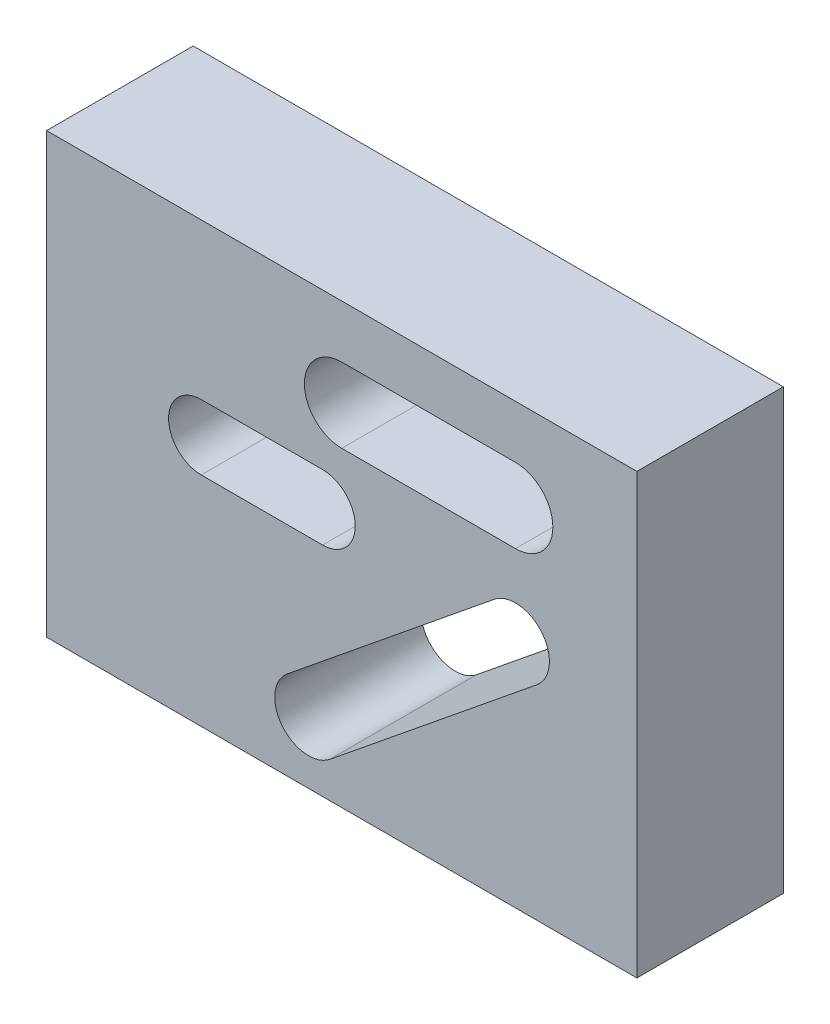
ISO-10303-21;
HEADER;
FILE_DESCRIPTION(('STEP AP214'),'2;1');
FILE_NAME('part.step','',(''),(''),'','','');
FILE_SCHEMA(('AUTOMOTIVE_DESIGN { 1 0 10303 214 1 1 1 1 }'));
ENDSEC;
DATA;
#1=APPLICATION_CONTEXT('core data for automotive mechanical design processes');
#2=APPLICATION_PROTOCOL_DEFINITION('international standard','automotive_design',2000,#1);
#3=PRODUCT_CONTEXT('',#1,'mechanical');
#4=PRODUCT('Part','Part','',(#3));
#5=PRODUCT_RELATED_PRODUCT_CATEGORY('part','',(#4));
#6=PRODUCT_DEFINITION_FORMATION('','',#4);
#7=PRODUCT_DEFINITION_CONTEXT('part definition',#1,'design');
#8=PRODUCT_DEFINITION('design','',#6,#7);
#9=PRODUCT_DEFINITION_SHAPE('','',#8);
#10=(LENGTH_UNIT() NAMED_UNIT(*) SI_UNIT(.MILLI.,.METRE.));
#11=(NAMED_UNIT(*) PLANE_ANGLE_UNIT() SI_UNIT($,.RADIAN.));
#12=(NAMED_UNIT(*) SI_UNIT($,.STERADIAN.) SOLID_ANGLE_UNIT());
#13=UNCERTAINTY_MEASURE_WITH_UNIT(LENGTH_MEASURE(1.E-05),#10,'distance_accuracy_value','');
#14=(GEOMETRIC_REPRESENTATION_CONTEXT(3) GLOBAL_UNCERTAINTY_ASSIGNED_CONTEXT((#13)) GLOBAL_UNIT_ASSIGNED_CONTEXT((#10,
#11,#12)) REPRESENTATION_CONTEXT('',''));
#15=CARTESIAN_POINT('',(0.,0.,0.));
#16=DIRECTION('',(0.,0.,1.));
#17=DIRECTION('',(1.,0.,0.));
#18=AXIS2_PLACEMENT_3D('',#15,#16,#17);
#19=CARTESIAN_POINT('',(0.,0.,26.));
#20=DIRECTION('',(0.,0.,-1.));
#21=DIRECTION('',(-1.,0.,0.));
#22=AXIS2_PLACEMENT_3D('',#19,#20,#21);
#23=PLANE('',#22);
#24=CARTESIAN_POINT('',(27.4409169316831,44.4523985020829,26.));
#25=DIRECTION('',(0.,0.,1.));
#26=DIRECTION('',(1.,0.,0.));
#27=AXIS2_PLACEMENT_3D('',#24,#25,#26);
#28=CIRCLE('',#27,5.79813893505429);
#29=CARTESIAN_POINT('',(27.4409169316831,50.2505374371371,26.));
#30=VERTEX_POINT('',#29);
#31=CARTESIAN_POINT('',(27.4409169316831,38.6542595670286,26.));
#32=VERTEX_POINT('',#31);
#33=EDGE_CURVE('E182',#30,#32,#28,.T.);
#34=ORIENTED_EDGE('',*,*,#33,.F.);
#35=DIRECTION('',(-1.,0.,0.));
#36=VECTOR('',#35,1.);
#37=CARTESIAN_POINT('',(27.4409169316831,50.2505374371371,26.));
#38=LINE('',#37,#36);
#39=CARTESIAN_POINT('',(48.976861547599,50.2505374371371,26.));
#40=VERTEX_POINT('',#39);
#41=EDGE_CURVE('E190',#40,#30,#38,.T.);
#42=ORIENTED_EDGE('',*,*,#41,.F.);
#43=CARTESIAN_POINT('',(48.976861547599,44.4523985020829,26.));
#44=DIRECTION('',(0.,0.,1.));
#45=DIRECTION('',(1.,0.,0.));
#46=AXIS2_PLACEMENT_3D('',#43,#44,#45);
#47=CIRCLE('',#46,5.79813893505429);
#48=CARTESIAN_POINT('',(48.976861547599,38.6542595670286,26.));
#49=VERTEX_POINT('',#48);
#50=EDGE_CURVE('E187',#49,#40,#47,.T.);
#51=ORIENTED_EDGE('',*,*,#50,.F.);
#52=DIRECTION('',(1.,0.,0.));
#53=VECTOR('',#52,1.);
#54=CARTESIAN_POINT('',(27.4409169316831,38.6542595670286,26.));
#55=LINE('',#54,#53);
#56=EDGE_CURVE('E184',#32,#49,#55,.T.);
#57=ORIENTED_EDGE('',*,*,#56,.F.);
#58=EDGE_LOOP('',(#34,#42,#51,#57));
#59=FACE_BOUND('',#58,.T.);
#60=DIRECTION('',(0.,-1.,0.));
#61=VECTOR('',#60,1.);
#62=CARTESIAN_POINT('',(0.,0.,26.));
#63=LINE('',#62,#61);
#64=CARTESIAN_POINT('',(0.,77.8607228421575,26.));
#65=VERTEX_POINT('',#64);
#66=CARTESIAN_POINT('',(0.,0.,26.));
#67=VERTEX_POINT('',#66);
#68=EDGE_CURVE('E244',#65,#67,#63,.T.);
#69=ORIENTED_EDGE('',*,*,#68,.T.);
#70=DIRECTION('',(1.,0.,0.));
#71=VECTOR('',#70,1.);
#72=CARTESIAN_POINT('',(0.,0.,26.));
#73=LINE('',#72,#71);
#74=CARTESIAN_POINT('',(104.74943606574,0.,26.));
#75=VERTEX_POINT('',#74);
#76=EDGE_CURVE('E247',#67,#75,#73,.T.);
#77=ORIENTED_EDGE('',*,*,#76,.T.);
#78=DIRECTION('',(0.,1.,0.));
#79=VECTOR('',#78,1.);
#80=CARTESIAN_POINT('',(104.74943606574,0.,26.));
#81=LINE('',#80,#79);
#82=CARTESIAN_POINT('',(104.74943606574,77.8607228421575,26.));
#83=VERTEX_POINT('',#82);
#84=EDGE_CURVE('E250',#75,#83,#81,.T.);
#85=ORIENTED_EDGE('',*,*,#84,.T.);
#86=DIRECTION('',(-1.,0.,0.));
#87=VECTOR('',#86,1.);
#88=CARTESIAN_POINT('',(0.,77.8607228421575,26.));
#89=LINE('',#88,#87);
#90=EDGE_CURVE('E252',#83,#65,#89,.T.);
#91=ORIENTED_EDGE('',*,*,#90,.T.);
#92=EDGE_LOOP('',(#69,#77,#85,#91));
#93=FACE_BOUND('',#92,.T.);
#94=CARTESIAN_POINT('',(52.3747180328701,61.8468153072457,26.));
#95=DIRECTION('',(0.,0.,1.));
#96=DIRECTION('',(1.,0.,0.));
#97=AXIS2_PLACEMENT_3D('',#94,#95,#96);
#98=CIRCLE('',#97,6.6264444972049);
#99=CARTESIAN_POINT('',(52.3747180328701,68.4732598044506,26.));
#100=VERTEX_POINT('',#99);
#101=CARTESIAN_POINT('',(52.3747180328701,55.2203708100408,26.));
#102=VERTEX_POINT('',#101);
#103=EDGE_CURVE('E213',#100,#102,#98,.T.);
#104=ORIENTED_EDGE('',*,*,#103,.F.);
#105=DIRECTION('',(-1.,0.,0.));
#106=VECTOR('',#105,1.);
#107=CARTESIAN_POINT('',(52.3747180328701,68.4732598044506,26.));
#108=LINE('',#107,#106);
#109=CARTESIAN_POINT('',(83.2134914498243,68.4732598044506,26.));
#110=VERTEX_POINT('',#109);
#111=EDGE_CURVE('E221',#110,#100,#108,.T.);
#112=ORIENTED_EDGE('',*,*,#111,.F.);
#113=CARTESIAN_POINT('',(83.2134914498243,61.8468153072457,26.));
#114=DIRECTION('',(0.,0.,1.));
#115=DIRECTION('',(1.,0.,0.));
#116=AXIS2_PLACEMENT_3D('',#113,#114,#115);
#117=CIRCLE('',#116,6.6264444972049);
#118=CARTESIAN_POINT('',(83.2134914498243,55.2203708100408,26.));
#119=VERTEX_POINT('',#118);
#120=EDGE_CURVE('E218',#119,#110,#117,.T.);
#121=ORIENTED_EDGE('',*,*,#120,.F.);
#122=DIRECTION('',(1.,0.,0.));
#123=VECTOR('',#122,1.);
#124=CARTESIAN_POINT('',(52.3747180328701,55.2203708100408,26.));
#125=LINE('',#124,#123);
#126=EDGE_CURVE('E215',#102,#119,#125,.T.);
#127=ORIENTED_EDGE('',*,*,#126,.F.);
#128=EDGE_LOOP('',(#104,#112,#121,#127));
#129=FACE_BOUND('',#128,.T.);
#130=CARTESIAN_POINT('',(83.2134914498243,40.8630743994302,26.));
#131=DIRECTION('',(0.,0.,1.));
#132=DIRECTION('',(1.,0.,0.));
#133=AXIS2_PLACEMENT_3D('',#130,#131,#132);
#134=CIRCLE('',#133,6.01268323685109);
#135=CARTESIAN_POINT('',(87.0037237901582,36.1954734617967,26.));
#136=VERTEX_POINT('',#135);
#137=CARTESIAN_POINT('',(79.4232591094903,45.5306753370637,26.));
#138=VERTEX_POINT('',#137);
#139=EDGE_CURVE('E146',#136,#138,#134,.T.);
#140=ORIENTED_EDGE('',*,*,#139,.F.);
#141=DIRECTION('',(0.77629250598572,0.630372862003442,0.));
#142=VECTOR('',#141,1.);
#143=CARTESIAN_POINT('',(87.0037237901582,36.1954734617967,26.));
#144=LINE('',#143,#142);
#145=CARTESIAN_POINT('',(50.2821772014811,6.3764732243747,26.));
#146=VERTEX_POINT('',#145);
#147=EDGE_CURVE('E168',#146,#136,#144,.T.);
#148=ORIENTED_EDGE('',*,*,#147,.F.);
#149=CARTESIAN_POINT('',(46.4919448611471,11.0440741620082,26.));
#150=DIRECTION('',(0.,0.,1.));
#151=DIRECTION('',(1.,0.,0.));
#152=AXIS2_PLACEMENT_3D('',#149,#150,#151);
#153=CIRCLE('',#152,6.01268323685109);
#154=CARTESIAN_POINT('',(42.7017125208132,15.7116750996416,26.));
#155=VERTEX_POINT('',#154);
#156=EDGE_CURVE('E166',#155,#146,#153,.T.);
#157=ORIENTED_EDGE('',*,*,#156,.F.);
#158=DIRECTION('',(-0.776292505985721,-0.630372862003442,0.));
#159=VECTOR('',#158,1.);
#160=CARTESIAN_POINT('',(79.4232591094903,45.5306753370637,26.));
#161=LINE('',#160,#159);
#162=EDGE_CURVE('E154',#138,#155,#161,.T.);
#163=ORIENTED_EDGE('',*,*,#162,.F.);
#164=EDGE_LOOP('',(#140,#148,#157,#163));
#165=FACE_BOUND('',#164,.T.);
#166=ADVANCED_FACE('F33',(#59,#93,#129,#165),#23,.F.);
#167=CARTESIAN_POINT('',(0.,0.,0.));
#168=DIRECTION('',(0.,0.,-1.));
#169=DIRECTION('',(-1.,0.,0.));
#170=AXIS2_PLACEMENT_3D('',#167,#168,#169);
#171=PLANE('',#170);
#172=DIRECTION('',(-1.,0.,0.));
#173=VECTOR('',#172,1.);
#174=CARTESIAN_POINT('',(27.4409169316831,50.2505374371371,0.));
#175=LINE('',#174,#173);
#176=CARTESIAN_POINT('',(48.976861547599,50.2505374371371,0.));
#177=VERTEX_POINT('',#176);
#178=CARTESIAN_POINT('',(27.4409169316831,50.2505374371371,0.));
#179=VERTEX_POINT('',#178);
#180=EDGE_CURVE('E185',#177,#179,#175,.T.);
#181=ORIENTED_EDGE('',*,*,#180,.T.);
#182=CARTESIAN_POINT('',(27.4409169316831,44.4523985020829,0.));
#183=DIRECTION('',(0.,0.,1.));
#184=DIRECTION('',(1.,0.,0.));
#185=AXIS2_PLACEMENT_3D('',#182,#183,#184);
#186=CIRCLE('',#185,5.79813893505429);
#187=CARTESIAN_POINT('',(27.4409169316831,38.6542595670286,0.));
#188=VERTEX_POINT('',#187);
#189=EDGE_CURVE('E162',#179,#188,#186,.T.);
#190=ORIENTED_EDGE('',*,*,#189,.T.);
#191=DIRECTION('',(1.,0.,0.));
#192=VECTOR('',#191,1.);
#193=CARTESIAN_POINT('',(27.4409169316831,38.6542595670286,0.));
#194=LINE('',#193,#192);
#195=CARTESIAN_POINT('',(48.976861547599,38.6542595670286,0.));
#196=VERTEX_POINT('',#195);
#197=EDGE_CURVE('E195',#188,#196,#194,.T.);
#198=ORIENTED_EDGE('',*,*,#197,.T.);
#199=CARTESIAN_POINT('',(48.976861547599,44.4523985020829,0.));
#200=DIRECTION('',(0.,0.,1.));
#201=DIRECTION('',(1.,0.,0.));
#202=AXIS2_PLACEMENT_3D('',#199,#200,#201);
#203=CIRCLE('',#202,5.79813893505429);
#204=EDGE_CURVE('E198',#196,#177,#203,.T.);
#205=ORIENTED_EDGE('',*,*,#204,.T.);
#206=EDGE_LOOP('',(#181,#190,#198,#205));
#207=FACE_BOUND('',#206,.T.);
#208=DIRECTION('',(0.,-1.,0.));
#209=VECTOR('',#208,1.);
#210=CARTESIAN_POINT('',(0.,0.,0.));
#211=LINE('',#210,#209);
#212=CARTESIAN_POINT('',(0.,77.8607228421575,0.));
#213=VERTEX_POINT('',#212);
#214=CARTESIAN_POINT('',(0.,0.,0.));
#215=VERTEX_POINT('',#214);
#216=EDGE_CURVE('E243',#213,#215,#211,.T.);
#217=ORIENTED_EDGE('',*,*,#216,.F.);
#218=DIRECTION('',(-1.,0.,0.));
#219=VECTOR('',#218,1.);
#220=CARTESIAN_POINT('',(0.,77.8607228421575,0.));
#221=LINE('',#220,#219);
#222=CARTESIAN_POINT('',(104.74943606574,77.8607228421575,0.));
#223=VERTEX_POINT('',#222);
#224=EDGE_CURVE('E248',#223,#213,#221,.T.);
#225=ORIENTED_EDGE('',*,*,#224,.F.);
#226=DIRECTION('',(0.,1.,0.));
#227=VECTOR('',#226,1.);
#228=CARTESIAN_POINT('',(104.74943606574,0.,0.));
#229=LINE('',#228,#227);
#230=CARTESIAN_POINT('',(104.74943606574,0.,0.));
#231=VERTEX_POINT('',#230);
#232=EDGE_CURVE('E259',#231,#223,#229,.T.);
#233=ORIENTED_EDGE('',*,*,#232,.F.);
#234=DIRECTION('',(1.,0.,0.));
#235=VECTOR('',#234,1.);
#236=CARTESIAN_POINT('',(0.,0.,0.));
#237=LINE('',#236,#235);
#238=EDGE_CURVE('E257',#215,#231,#237,.T.);
#239=ORIENTED_EDGE('',*,*,#238,.F.);
#240=EDGE_LOOP('',(#217,#225,#233,#239));
#241=FACE_BOUND('',#240,.T.);
#242=DIRECTION('',(-1.,0.,0.));
#243=VECTOR('',#242,1.);
#244=CARTESIAN_POINT('',(52.3747180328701,68.4732598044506,0.));
#245=LINE('',#244,#243);
#246=CARTESIAN_POINT('',(83.2134914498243,68.4732598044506,0.));
#247=VERTEX_POINT('',#246);
#248=CARTESIAN_POINT('',(52.3747180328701,68.4732598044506,0.));
#249=VERTEX_POINT('',#248);
#250=EDGE_CURVE('E216',#247,#249,#245,.T.);
#251=ORIENTED_EDGE('',*,*,#250,.T.);
#252=CARTESIAN_POINT('',(52.3747180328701,61.8468153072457,0.));
#253=DIRECTION('',(0.,0.,1.));
#254=DIRECTION('',(1.,0.,0.));
#255=AXIS2_PLACEMENT_3D('',#252,#253,#254);
#256=CIRCLE('',#255,6.6264444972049);
#257=CARTESIAN_POINT('',(52.3747180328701,55.2203708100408,0.));
#258=VERTEX_POINT('',#257);
#259=EDGE_CURVE('E212',#249,#258,#256,.T.);
#260=ORIENTED_EDGE('',*,*,#259,.T.);
#261=DIRECTION('',(1.,0.,0.));
#262=VECTOR('',#261,1.);
#263=CARTESIAN_POINT('',(52.3747180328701,55.2203708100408,0.));
#264=LINE('',#263,#262);
#265=CARTESIAN_POINT('',(83.2134914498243,55.2203708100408,0.));
#266=VERTEX_POINT('',#265);
#267=EDGE_CURVE('E226',#258,#266,#264,.T.);
#268=ORIENTED_EDGE('',*,*,#267,.T.);
#269=CARTESIAN_POINT('',(83.2134914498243,61.8468153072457,0.));
#270=DIRECTION('',(0.,0.,1.));
#271=DIRECTION('',(1.,0.,0.));
#272=AXIS2_PLACEMENT_3D('',#269,#270,#271);
#273=CIRCLE('',#272,6.6264444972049);
#274=EDGE_CURVE('E229',#266,#247,#273,.T.);
#275=ORIENTED_EDGE('',*,*,#274,.T.);
#276=EDGE_LOOP('',(#251,#260,#268,#275));
#277=FACE_BOUND('',#276,.T.);
#278=DIRECTION('',(0.77629250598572,0.630372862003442,0.));
#279=VECTOR('',#278,1.);
#280=CARTESIAN_POINT('',(87.0037237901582,36.1954734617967,0.));
#281=LINE('',#280,#279);
#282=CARTESIAN_POINT('',(50.2821772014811,6.3764732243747,0.));
#283=VERTEX_POINT('',#282);
#284=CARTESIAN_POINT('',(87.0037237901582,36.1954734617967,0.));
#285=VERTEX_POINT('',#284);
#286=EDGE_CURVE('E155',#283,#285,#281,.T.);
#287=ORIENTED_EDGE('',*,*,#286,.T.);
#288=CARTESIAN_POINT('',(83.2134914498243,40.8630743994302,0.));
#289=DIRECTION('',(0.,0.,1.));
#290=DIRECTION('',(1.,0.,0.));
#291=AXIS2_PLACEMENT_3D('',#288,#289,#290);
#292=CIRCLE('',#291,6.01268323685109);
#293=CARTESIAN_POINT('',(79.4232591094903,45.5306753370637,0.));
#294=VERTEX_POINT('',#293);
#295=EDGE_CURVE('E56',#285,#294,#292,.T.);
#296=ORIENTED_EDGE('',*,*,#295,.T.);
#297=DIRECTION('',(-0.776292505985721,-0.630372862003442,0.));
#298=VECTOR('',#297,1.);
#299=CARTESIAN_POINT('',(79.4232591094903,45.5306753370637,0.));
#300=LINE('',#299,#298);
#301=CARTESIAN_POINT('',(42.7017125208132,15.7116750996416,0.));
#302=VERTEX_POINT('',#301);
#303=EDGE_CURVE('E161',#294,#302,#300,.T.);
#304=ORIENTED_EDGE('',*,*,#303,.T.);
#305=CARTESIAN_POINT('',(46.4919448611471,11.0440741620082,0.));
#306=DIRECTION('',(0.,0.,1.));
#307=DIRECTION('',(1.,0.,0.));
#308=AXIS2_PLACEMENT_3D('',#305,#306,#307);
#309=CIRCLE('',#308,6.01268323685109);
#310=EDGE_CURVE('E174',#302,#283,#309,.T.);
#311=ORIENTED_EDGE('',*,*,#310,.T.);
#312=EDGE_LOOP('',(#287,#296,#304,#311));
#313=FACE_BOUND('',#312,.T.);
#314=ADVANCED_FACE('F277',(#207,#241,#277,#313),#171,.T.);
#315=CARTESIAN_POINT('',(0.,0.,26.));
#316=DIRECTION('',(1.,0.,0.));
#317=DIRECTION('',(0.,0.,-1.));
#318=AXIS2_PLACEMENT_3D('',#315,#316,#317);
#319=PLANE('',#318);
#320=ORIENTED_EDGE('',*,*,#216,.T.);
#321=DIRECTION('',(0.,0.,-1.));
#322=VECTOR('',#321,1.);
#323=CARTESIAN_POINT('',(0.,0.,26.));
#324=LINE('',#323,#322);
#325=EDGE_CURVE('E11',#67,#215,#324,.T.);
#326=ORIENTED_EDGE('',*,*,#325,.F.);
#327=ORIENTED_EDGE('',*,*,#68,.F.);
#328=DIRECTION('',(0.,0.,-1.));
#329=VECTOR('',#328,1.);
#330=CARTESIAN_POINT('',(0.,77.8607228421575,26.));
#331=LINE('',#330,#329);
#332=EDGE_CURVE('E254',#65,#213,#331,.T.);
#333=ORIENTED_EDGE('',*,*,#332,.T.);
#334=EDGE_LOOP('',(#320,#326,#327,#333));
#335=FACE_BOUND('',#334,.T.);
#336=ADVANCED_FACE('F35',(#335),#319,.F.);
#337=CARTESIAN_POINT('',(0.,0.,26.));
#338=DIRECTION('',(0.,1.,0.));
#339=DIRECTION('',(0.,0.,1.));
#340=AXIS2_PLACEMENT_3D('',#337,#338,#339);
#341=PLANE('',#340);
#342=ORIENTED_EDGE('',*,*,#238,.T.);
#343=DIRECTION('',(0.,0.,-1.));
#344=VECTOR('',#343,1.);
#345=CARTESIAN_POINT('',(104.74943606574,0.,26.));
#346=LINE('',#345,#344);
#347=EDGE_CURVE('E41',#75,#231,#346,.T.);
#348=ORIENTED_EDGE('',*,*,#347,.F.);
#349=ORIENTED_EDGE('',*,*,#76,.F.);
#350=ORIENTED_EDGE('',*,*,#325,.T.);
#351=EDGE_LOOP('',(#342,#348,#349,#350));
#352=FACE_BOUND('',#351,.T.);
#353=ADVANCED_FACE('F288',(#352),#341,.F.);
#354=CARTESIAN_POINT('',(104.74943606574,0.,26.));
#355=DIRECTION('',(-1.,0.,0.));
#356=DIRECTION('',(0.,0.,1.));
#357=AXIS2_PLACEMENT_3D('',#354,#355,#356);
#358=PLANE('',#357);
#359=ORIENTED_EDGE('',*,*,#232,.T.);
#360=DIRECTION('',(0.,0.,-1.));
#361=VECTOR('',#360,1.);
#362=CARTESIAN_POINT('',(104.74943606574,77.8607228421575,26.));
#363=LINE('',#362,#361);
#364=EDGE_CURVE('E264',#83,#223,#363,.T.);
#365=ORIENTED_EDGE('',*,*,#364,.F.);
#366=ORIENTED_EDGE('',*,*,#84,.F.);
#367=ORIENTED_EDGE('',*,*,#347,.T.);
#368=EDGE_LOOP('',(#359,#365,#366,#367));
#369=FACE_BOUND('',#368,.T.);
#370=ADVANCED_FACE('F271',(#369),#358,.F.);
#371=CARTESIAN_POINT('',(0.,77.8607228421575,26.));
#372=DIRECTION('',(0.,-1.,0.));
#373=DIRECTION('',(0.,0.,-1.));
#374=AXIS2_PLACEMENT_3D('',#371,#372,#373);
#375=PLANE('',#374);
#376=ORIENTED_EDGE('',*,*,#224,.T.);
#377=ORIENTED_EDGE('',*,*,#332,.F.);
#378=ORIENTED_EDGE('',*,*,#90,.F.);
#379=ORIENTED_EDGE('',*,*,#364,.T.);
#380=EDGE_LOOP('',(#376,#377,#378,#379));
#381=FACE_BOUND('',#380,.T.);
#382=ADVANCED_FACE('F281',(#381),#375,.F.);
#383=CARTESIAN_POINT('',(52.3747180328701,61.8468153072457,26.));
#384=DIRECTION('',(0.,0.,-1.));
#385=DIRECTION('',(-1.,0.,0.));
#386=AXIS2_PLACEMENT_3D('',#383,#384,#385);
#387=CYLINDRICAL_SURFACE('',#386,6.6264444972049);
#388=ORIENTED_EDGE('',*,*,#259,.F.);
#389=DIRECTION('',(0.,0.,-1.));
#390=VECTOR('',#389,1.);
#391=CARTESIAN_POINT('',(52.3747180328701,68.4732598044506,26.));
#392=LINE('',#391,#390);
#393=EDGE_CURVE('E223',#100,#249,#392,.T.);
#394=ORIENTED_EDGE('',*,*,#393,.F.);
#395=ORIENTED_EDGE('',*,*,#103,.T.);
#396=DIRECTION('',(0.,0.,-1.));
#397=VECTOR('',#396,1.);
#398=CARTESIAN_POINT('',(52.3747180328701,55.2203708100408,26.));
#399=LINE('',#398,#397);
#400=EDGE_CURVE('E240',#102,#258,#399,.T.);
#401=ORIENTED_EDGE('',*,*,#400,.T.);
#402=EDGE_LOOP('',(#388,#394,#395,#401));
#403=FACE_BOUND('',#402,.T.);
#404=ADVANCED_FACE('F305',(#403),#387,.F.);
#405=CARTESIAN_POINT('',(52.3747180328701,55.2203708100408,26.));
#406=DIRECTION('',(0.,1.,0.));
#407=DIRECTION('',(0.,0.,1.));
#408=AXIS2_PLACEMENT_3D('',#405,#406,#407);
#409=PLANE('',#408);
#410=ORIENTED_EDGE('',*,*,#267,.F.);
#411=ORIENTED_EDGE('',*,*,#400,.F.);
#412=ORIENTED_EDGE('',*,*,#126,.T.);
#413=DIRECTION('',(0.,0.,-1.));
#414=VECTOR('',#413,1.);
#415=CARTESIAN_POINT('',(83.2134914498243,55.2203708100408,26.));
#416=LINE('',#415,#414);
#417=EDGE_CURVE('E238',#119,#266,#416,.T.);
#418=ORIENTED_EDGE('',*,*,#417,.T.);
#419=EDGE_LOOP('',(#410,#411,#412,#418));
#420=FACE_BOUND('',#419,.T.);
#421=ADVANCED_FACE('F312',(#420),#409,.T.);
#422=CARTESIAN_POINT('',(83.2134914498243,61.8468153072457,26.));
#423=DIRECTION('',(0.,0.,-1.));
#424=DIRECTION('',(-1.,0.,0.));
#425=AXIS2_PLACEMENT_3D('',#422,#423,#424);
#426=CYLINDRICAL_SURFACE('',#425,6.6264444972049);
#427=ORIENTED_EDGE('',*,*,#274,.F.);
#428=ORIENTED_EDGE('',*,*,#417,.F.);
#429=ORIENTED_EDGE('',*,*,#120,.T.);
#430=DIRECTION('',(0.,0.,-1.));
#431=VECTOR('',#430,1.);
#432=CARTESIAN_POINT('',(83.2134914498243,68.4732598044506,26.));
#433=LINE('',#432,#431);
#434=EDGE_CURVE('E236',#110,#247,#433,.T.);
#435=ORIENTED_EDGE('',*,*,#434,.T.);
#436=EDGE_LOOP('',(#427,#428,#429,#435));
#437=FACE_BOUND('',#436,.T.);
#438=ADVANCED_FACE('F317',(#437),#426,.F.);
#439=CARTESIAN_POINT('',(52.3747180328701,68.4732598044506,26.));
#440=DIRECTION('',(0.,-1.,0.));
#441=DIRECTION('',(0.,0.,-1.));
#442=AXIS2_PLACEMENT_3D('',#439,#440,#441);
#443=PLANE('',#442);
#444=ORIENTED_EDGE('',*,*,#250,.F.);
#445=ORIENTED_EDGE('',*,*,#434,.F.);
#446=ORIENTED_EDGE('',*,*,#111,.T.);
#447=ORIENTED_EDGE('',*,*,#393,.T.);
#448=EDGE_LOOP('',(#444,#445,#446,#447));
#449=FACE_BOUND('',#448,.T.);
#450=ADVANCED_FACE('F324',(#449),#443,.T.);
#451=CARTESIAN_POINT('',(27.4409169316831,44.4523985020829,26.));
#452=DIRECTION('',(0.,0.,-1.));
#453=DIRECTION('',(-1.,0.,0.));
#454=AXIS2_PLACEMENT_3D('',#451,#452,#453);
#455=CYLINDRICAL_SURFACE('',#454,5.79813893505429);
#456=ORIENTED_EDGE('',*,*,#189,.F.);
#457=DIRECTION('',(0.,0.,-1.));
#458=VECTOR('',#457,1.);
#459=CARTESIAN_POINT('',(27.4409169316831,50.2505374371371,26.));
#460=LINE('',#459,#458);
#461=EDGE_CURVE('E192',#30,#179,#460,.T.);
#462=ORIENTED_EDGE('',*,*,#461,.F.);
#463=ORIENTED_EDGE('',*,*,#33,.T.);
#464=DIRECTION('',(0.,0.,-1.));
#465=VECTOR('',#464,1.);
#466=CARTESIAN_POINT('',(27.4409169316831,38.6542595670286,26.));
#467=LINE('',#466,#465);
#468=EDGE_CURVE('E209',#32,#188,#467,.T.);
#469=ORIENTED_EDGE('',*,*,#468,.T.);
#470=EDGE_LOOP('',(#456,#462,#463,#469));
#471=FACE_BOUND('',#470,.T.);
#472=ADVANCED_FACE('F337',(#471),#455,.F.);
#473=CARTESIAN_POINT('',(27.4409169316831,38.6542595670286,26.));
#474=DIRECTION('',(0.,1.,0.));
#475=DIRECTION('',(0.,0.,1.));
#476=AXIS2_PLACEMENT_3D('',#473,#474,#475);
#477=PLANE('',#476);
#478=ORIENTED_EDGE('',*,*,#197,.F.);
#479=ORIENTED_EDGE('',*,*,#468,.F.);
#480=ORIENTED_EDGE('',*,*,#56,.T.);
#481=DIRECTION('',(0.,0.,-1.));
#482=VECTOR('',#481,1.);
#483=CARTESIAN_POINT('',(48.976861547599,38.6542595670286,26.));
#484=LINE('',#483,#482);
#485=EDGE_CURVE('E207',#49,#196,#484,.T.);
#486=ORIENTED_EDGE('',*,*,#485,.T.);
#487=EDGE_LOOP('',(#478,#479,#480,#486));
#488=FACE_BOUND('',#487,.T.);
#489=ADVANCED_FACE('F342',(#488),#477,.T.);
#490=CARTESIAN_POINT('',(48.976861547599,44.4523985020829,26.));
#491=DIRECTION('',(0.,0.,-1.));
#492=DIRECTION('',(-1.,0.,0.));
#493=AXIS2_PLACEMENT_3D('',#490,#491,#492);
#494=CYLINDRICAL_SURFACE('',#493,5.79813893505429);
#495=ORIENTED_EDGE('',*,*,#204,.F.);
#496=ORIENTED_EDGE('',*,*,#485,.F.);
#497=ORIENTED_EDGE('',*,*,#50,.T.);
#498=DIRECTION('',(0.,0.,-1.));
#499=VECTOR('',#498,1.);
#500=CARTESIAN_POINT('',(48.976861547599,50.2505374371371,26.));
#501=LINE('',#500,#499);
#502=EDGE_CURVE('E205',#40,#177,#501,.T.);
#503=ORIENTED_EDGE('',*,*,#502,.T.);
#504=EDGE_LOOP('',(#495,#496,#497,#503));
#505=FACE_BOUND('',#504,.T.);
#506=ADVANCED_FACE('F346',(#505),#494,.F.);
#507=CARTESIAN_POINT('',(27.4409169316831,50.2505374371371,26.));
#508=DIRECTION('',(0.,-1.,0.));
#509=DIRECTION('',(0.,0.,-1.));
#510=AXIS2_PLACEMENT_3D('',#507,#508,#509);
#511=PLANE('',#510);
#512=ORIENTED_EDGE('',*,*,#180,.F.);
#513=ORIENTED_EDGE('',*,*,#502,.F.);
#514=ORIENTED_EDGE('',*,*,#41,.T.);
#515=ORIENTED_EDGE('',*,*,#461,.T.);
#516=EDGE_LOOP('',(#512,#513,#514,#515));
#517=FACE_BOUND('',#516,.T.);
#518=ADVANCED_FACE('F350',(#517),#511,.T.);
#519=CARTESIAN_POINT('',(83.2134914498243,40.8630743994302,26.));
#520=DIRECTION('',(0.,0.,-1.));
#521=DIRECTION('',(-1.,0.,0.));
#522=AXIS2_PLACEMENT_3D('',#519,#520,#521);
#523=CYLINDRICAL_SURFACE('',#522,6.01268323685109);
#524=ORIENTED_EDGE('',*,*,#295,.F.);
#525=DIRECTION('',(0.,0.,-1.));
#526=VECTOR('',#525,1.);
#527=CARTESIAN_POINT('',(87.0037237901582,36.1954734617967,26.));
#528=LINE('',#527,#526);
#529=EDGE_CURVE('E150',#136,#285,#528,.T.);
#530=ORIENTED_EDGE('',*,*,#529,.F.);
#531=ORIENTED_EDGE('',*,*,#139,.T.);
#532=DIRECTION('',(0.,0.,-1.));
#533=VECTOR('',#532,1.);
#534=CARTESIAN_POINT('',(79.4232591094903,45.5306753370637,26.));
#535=LINE('',#534,#533);
#536=EDGE_CURVE('E149',#138,#294,#535,.T.);
#537=ORIENTED_EDGE('',*,*,#536,.T.);
#538=EDGE_LOOP('',(#524,#530,#531,#537));
#539=FACE_BOUND('',#538,.T.);
#540=ADVANCED_FACE('F148',(#539),#523,.F.);
#541=CARTESIAN_POINT('',(79.4232591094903,45.5306753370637,26.));
#542=DIRECTION('',(0.630372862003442,-0.776292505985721,0.));
#543=DIRECTION('',(0.776292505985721,0.630372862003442,0.));
#544=AXIS2_PLACEMENT_3D('',#541,#542,#543);
#545=PLANE('',#544);
#546=ORIENTED_EDGE('',*,*,#303,.F.);
#547=ORIENTED_EDGE('',*,*,#536,.F.);
#548=ORIENTED_EDGE('',*,*,#162,.T.);
#549=DIRECTION('',(0.,0.,-1.));
#550=VECTOR('',#549,1.);
#551=CARTESIAN_POINT('',(42.7017125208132,15.7116750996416,26.));
#552=LINE('',#551,#550);
#553=EDGE_CURVE('E163',#155,#302,#552,.T.);
#554=ORIENTED_EDGE('',*,*,#553,.T.);
#555=EDGE_LOOP('',(#546,#547,#548,#554));
#556=FACE_BOUND('',#555,.T.);
#557=ADVANCED_FACE('F158',(#556),#545,.T.);
#558=CARTESIAN_POINT('',(46.4919448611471,11.0440741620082,26.));
#559=DIRECTION('',(0.,0.,-1.));
#560=DIRECTION('',(-1.,0.,0.));
#561=AXIS2_PLACEMENT_3D('',#558,#559,#560);
#562=CYLINDRICAL_SURFACE('',#561,6.01268323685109);
#563=ORIENTED_EDGE('',*,*,#310,.F.);
#564=ORIENTED_EDGE('',*,*,#553,.F.);
#565=ORIENTED_EDGE('',*,*,#156,.T.);
#566=DIRECTION('',(0.,0.,-1.));
#567=VECTOR('',#566,1.);
#568=CARTESIAN_POINT('',(50.2821772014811,6.3764732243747,26.));
#569=LINE('',#568,#567);
#570=EDGE_CURVE('E48',#146,#283,#569,.T.);
#571=ORIENTED_EDGE('',*,*,#570,.T.);
#572=EDGE_LOOP('',(#563,#564,#565,#571));
#573=FACE_BOUND('',#572,.T.);
#574=ADVANCED_FACE('F359',(#573),#562,.F.);
#575=CARTESIAN_POINT('',(87.0037237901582,36.1954734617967,26.));
#576=DIRECTION('',(-0.630372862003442,0.77629250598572,0.));
#577=DIRECTION('',(-0.776292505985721,-0.630372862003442,0.));
#578=AXIS2_PLACEMENT_3D('',#575,#576,#577);
#579=PLANE('',#578);
#580=ORIENTED_EDGE('',*,*,#286,.F.);
#581=ORIENTED_EDGE('',*,*,#570,.F.);
#582=ORIENTED_EDGE('',*,*,#147,.T.);
#583=ORIENTED_EDGE('',*,*,#529,.T.);
#584=EDGE_LOOP('',(#580,#581,#582,#583));
#585=FACE_BOUND('',#584,.T.);
#586=ADVANCED_FACE('F362',(#585),#579,.T.);
#587=CLOSED_SHELL('',(#166,#314,#336,#353,#370,#382,#404,#421,#438,#450,#472,#489,#506,#518,
#540,#557,#574,#586));
#588=MANIFOLD_SOLID_BREP('B2',#587);
#589=ADVANCED_BREP_SHAPE_REPRESENTATION('',(#18,#588),#14);
#590=SHAPE_DEFINITION_REPRESENTATION(#9,#589);
ENDSEC;
END-ISO-10303-21;
